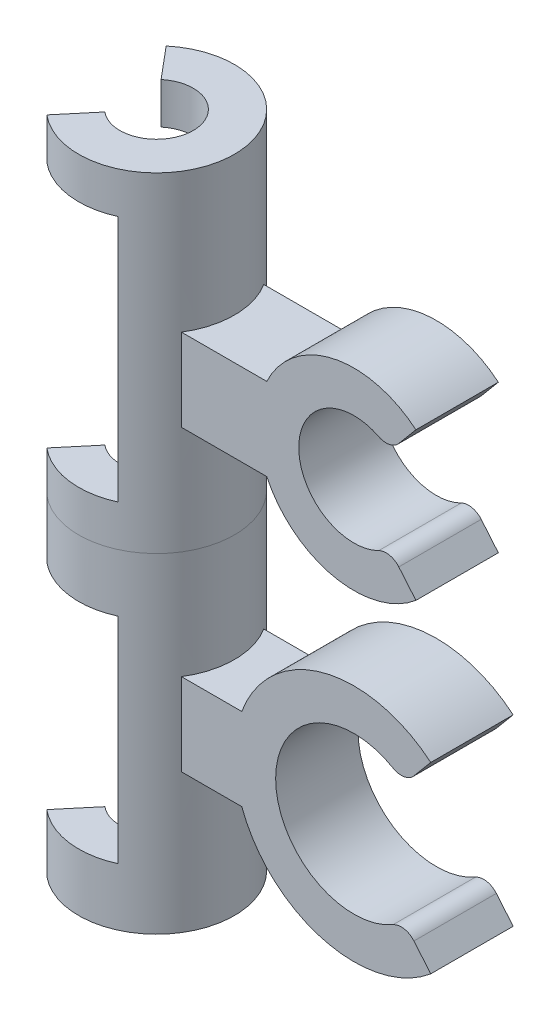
ISO-10303-21;
HEADER;
FILE_DESCRIPTION(('STEP AP214'),'2;1');
FILE_NAME('part.step','',(''),(''),'','','');
FILE_SCHEMA(('AUTOMOTIVE_DESIGN { 1 0 10303 214 1 1 1 1 }'));
ENDSEC;
DATA;
#1=APPLICATION_CONTEXT('core data for automotive mechanical design processes');
#2=APPLICATION_PROTOCOL_DEFINITION('international standard','automotive_design',2000,#1);
#3=PRODUCT_CONTEXT('',#1,'mechanical');
#4=PRODUCT('Part','Part','',(#3));
#5=PRODUCT_RELATED_PRODUCT_CATEGORY('part','',(#4));
#6=PRODUCT_DEFINITION_FORMATION('','',#4);
#7=PRODUCT_DEFINITION_CONTEXT('part definition',#1,'design');
#8=PRODUCT_DEFINITION('design','',#6,#7);
#9=PRODUCT_DEFINITION_SHAPE('','',#8);
#10=(LENGTH_UNIT() NAMED_UNIT(*) SI_UNIT(.MILLI.,.METRE.));
#11=(NAMED_UNIT(*) PLANE_ANGLE_UNIT() SI_UNIT($,.RADIAN.));
#12=(NAMED_UNIT(*) SI_UNIT($,.STERADIAN.) SOLID_ANGLE_UNIT());
#13=UNCERTAINTY_MEASURE_WITH_UNIT(LENGTH_MEASURE(1.E-05),#10,'distance_accuracy_value','');
#14=(GEOMETRIC_REPRESENTATION_CONTEXT(3) GLOBAL_UNCERTAINTY_ASSIGNED_CONTEXT((#13)) GLOBAL_UNIT_ASSIGNED_CONTEXT((#10,
#11,#12)) REPRESENTATION_CONTEXT('',''));
#15=CARTESIAN_POINT('',(0.,0.,0.));
#16=DIRECTION('',(0.,0.,1.));
#17=DIRECTION('',(1.,0.,0.));
#18=AXIS2_PLACEMENT_3D('',#15,#16,#17);
#19=CARTESIAN_POINT('',(0.,0.,0.));
#20=DIRECTION('',(0.,1.,0.));
#21=DIRECTION('',(0.,0.,1.));
#22=AXIS2_PLACEMENT_3D('',#19,#20,#21);
#23=PLANE('',#22);
#24=DIRECTION('',(0.642787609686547,0.,0.766044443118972));
#25=VECTOR('',#24,1.);
#26=CARTESIAN_POINT('',(-2.86040486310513,0.,-3.40889777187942));
#27=LINE('',#26,#25);
#28=CARTESIAN_POINT('',(-6.07434291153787,0.,-7.23911998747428));
#29=VERTEX_POINT('',#28);
#30=CARTESIAN_POINT('',(-2.86040486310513,0.,-3.40889777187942));
#31=VERTEX_POINT('',#30);
#32=EDGE_CURVE('E346',#29,#31,#27,.T.);
#33=ORIENTED_EDGE('',*,*,#32,.F.);
#34=CARTESIAN_POINT('',(0.,0.,0.));
#35=DIRECTION('',(0.,1.,0.));
#36=DIRECTION('',(0.,0.,1.));
#37=AXIS2_PLACEMENT_3D('',#34,#35,#36);
#38=CIRCLE('',#37,9.45);
#39=CARTESIAN_POINT('',(-6.07434291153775,0.,7.23911998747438));
#40=VERTEX_POINT('',#39);
#41=EDGE_CURVE('E349',#40,#29,#38,.T.);
#42=ORIENTED_EDGE('',*,*,#41,.F.);
#43=DIRECTION('',(-0.642787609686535,0.,0.766044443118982));
#44=VECTOR('',#43,1.);
#45=CARTESIAN_POINT('',(-6.07434291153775,0.,7.23911998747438));
#46=LINE('',#45,#44);
#47=CARTESIAN_POINT('',(-2.86040486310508,0.,3.40889777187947));
#48=VERTEX_POINT('',#47);
#49=EDGE_CURVE('E131',#48,#40,#46,.T.);
#50=ORIENTED_EDGE('',*,*,#49,.F.);
#51=CARTESIAN_POINT('',(0.,0.,0.));
#52=DIRECTION('',(0.,1.,0.));
#53=DIRECTION('',(0.,0.,1.));
#54=AXIS2_PLACEMENT_3D('',#51,#52,#53);
#55=CIRCLE('',#54,4.45);
#56=EDGE_CURVE('E14',#31,#48,#55,.F.);
#57=ORIENTED_EDGE('',*,*,#56,.F.);
#58=EDGE_LOOP('',(#33,#42,#50,#57));
#59=FACE_BOUND('',#58,.T.);
#60=ADVANCED_FACE('F124',(#59),#23,.F.);
#61=CARTESIAN_POINT('',(28.95,18.1,5.));
#62=DIRECTION('',(0.,0.,-1.));
#63=DIRECTION('',(-1.,0.,0.));
#64=AXIS2_PLACEMENT_3D('',#61,#62,#63);
#65=CYLINDRICAL_SURFACE('',#64,11.7);
#66=CARTESIAN_POINT('',(28.95,18.1,-5.));
#67=DIRECTION('',(0.,0.,1.));
#68=DIRECTION('',(1.,0.,0.));
#69=AXIS2_PLACEMENT_3D('',#66,#67,#68);
#70=CIRCLE('',#69,11.7);
#71=CARTESIAN_POINT('',(36.4706150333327,27.0627199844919,-5.));
#72=VERTEX_POINT('',#71);
#73=CARTESIAN_POINT('',(18.3721930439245,23.1,-5.));
#74=VERTEX_POINT('',#73);
#75=EDGE_CURVE('E410',#72,#74,#70,.T.);
#76=ORIENTED_EDGE('',*,*,#75,.T.);
#77=DIRECTION('',(0.,0.,-1.));
#78=VECTOR('',#77,1.);
#79=CARTESIAN_POINT('',(18.3721930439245,23.1,5.));
#80=LINE('',#79,#78);
#81=CARTESIAN_POINT('',(18.3721930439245,23.1,5.));
#82=VERTEX_POINT('',#81);
#83=EDGE_CURVE('E405',#82,#74,#80,.T.);
#84=ORIENTED_EDGE('',*,*,#83,.F.);
#85=CARTESIAN_POINT('',(28.95,18.1,5.));
#86=DIRECTION('',(0.,0.,1.));
#87=DIRECTION('',(1.,0.,0.));
#88=AXIS2_PLACEMENT_3D('',#85,#86,#87);
#89=CIRCLE('',#88,11.7);
#90=CARTESIAN_POINT('',(36.4706150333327,27.0627199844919,5.));
#91=VERTEX_POINT('',#90);
#92=EDGE_CURVE('E394',#91,#82,#89,.T.);
#93=ORIENTED_EDGE('',*,*,#92,.F.);
#94=DIRECTION('',(0.,0.,-1.));
#95=VECTOR('',#94,1.);
#96=CARTESIAN_POINT('',(36.4706150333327,27.0627199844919,5.));
#97=LINE('',#96,#95);
#98=EDGE_CURVE('E422',#91,#72,#97,.T.);
#99=ORIENTED_EDGE('',*,*,#98,.T.);
#100=EDGE_LOOP('',(#76,#84,#93,#99));
#101=FACE_BOUND('',#100,.T.);
#102=ADVANCED_FACE('F479',(#101),#65,.T.);
#103=CARTESIAN_POINT('',(8.07604720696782,-6.77660823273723,5.));
#104=DIRECTION('',(0.766044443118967,-0.642787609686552,0.));
#105=DIRECTION('',(0.642787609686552,0.766044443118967,0.));
#106=AXIS2_PLACEMENT_3D('',#103,#104,#105);
#107=PLANE('',#106);
#108=DIRECTION('',(-0.642787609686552,-0.766044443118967,0.));
#109=VECTOR('',#108,1.);
#110=CARTESIAN_POINT('',(8.07604720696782,-6.77660823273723,5.));
#111=LINE('',#110,#109);
#112=CARTESIAN_POINT('',(34.3924793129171,24.5860942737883,5.));
#113=VERTEX_POINT('',#112);
#114=EDGE_CURVE('E400',#91,#113,#111,.T.);
#115=ORIENTED_EDGE('',*,*,#114,.T.);
#116=DIRECTION('',(0.,0.,-1.));
#117=VECTOR('',#116,1.);
#118=CARTESIAN_POINT('',(34.3924793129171,24.5860942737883,5.));
#119=LINE('',#118,#117);
#120=CARTESIAN_POINT('',(34.3924793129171,24.5860942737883,-5.));
#121=VERTEX_POINT('',#120);
#122=EDGE_CURVE('E343',#113,#121,#119,.T.);
#123=ORIENTED_EDGE('',*,*,#122,.T.);
#124=DIRECTION('',(-0.642787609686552,-0.766044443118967,0.));
#125=VECTOR('',#124,1.);
#126=CARTESIAN_POINT('',(8.07604720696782,-6.77660823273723,-5.));
#127=LINE('',#126,#125);
#128=EDGE_CURVE('E416',#72,#121,#127,.T.);
#129=ORIENTED_EDGE('',*,*,#128,.F.);
#130=ORIENTED_EDGE('',*,*,#98,.F.);
#131=EDGE_LOOP('',(#115,#123,#129,#130));
#132=FACE_BOUND('',#131,.T.);
#133=ADVANCED_FACE('F483',(#132),#107,.T.);
#134=CARTESIAN_POINT('',(32.8603904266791,25.8716694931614,5.));
#135=DIRECTION('',(0.,0.,-1.));
#136=DIRECTION('',(-1.,0.,0.));
#137=AXIS2_PLACEMENT_3D('',#134,#135,#136);
#138=CYLINDRICAL_SURFACE('',#137,2.);
#139=CARTESIAN_POINT('',(32.8603904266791,25.8716694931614,5.));
#140=DIRECTION('',(0.,0.,1.));
#141=DIRECTION('',(1.,0.,0.));
#142=AXIS2_PLACEMENT_3D('',#139,#140,#141);
#143=CIRCLE('',#142,2.);
#144=CARTESIAN_POINT('',(31.9614500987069,24.0850788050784,5.));
#145=VERTEX_POINT('',#144);
#146=EDGE_CURVE('E339',#145,#113,#143,.T.);
#147=ORIENTED_EDGE('',*,*,#146,.F.);
#148=DIRECTION('',(0.,0.,-1.));
#149=VECTOR('',#148,1.);
#150=CARTESIAN_POINT('',(31.9614500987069,24.0850788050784,5.));
#151=LINE('',#150,#149);
#152=CARTESIAN_POINT('',(31.9614500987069,24.0850788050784,-5.));
#153=VERTEX_POINT('',#152);
#154=EDGE_CURVE('E328',#153,#145,#151,.F.);
#155=ORIENTED_EDGE('',*,*,#154,.F.);
#156=CARTESIAN_POINT('',(32.8603904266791,25.8716694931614,-5.));
#157=DIRECTION('',(0.,0.,1.));
#158=DIRECTION('',(1.,0.,0.));
#159=AXIS2_PLACEMENT_3D('',#156,#157,#158);
#160=CIRCLE('',#159,2.);
#161=EDGE_CURVE('E333',#121,#153,#160,.F.);
#162=ORIENTED_EDGE('',*,*,#161,.F.);
#163=ORIENTED_EDGE('',*,*,#122,.F.);
#164=EDGE_LOOP('',(#147,#155,#162,#163));
#165=FACE_BOUND('',#164,.T.);
#166=ADVANCED_FACE('F516',(#165),#138,.T.);
#167=CARTESIAN_POINT('',(28.95,18.1,5.));
#168=DIRECTION('',(0.,0.,-1.));
#169=DIRECTION('',(-1.,0.,0.));
#170=AXIS2_PLACEMENT_3D('',#167,#168,#169);
#171=CYLINDRICAL_SURFACE('',#170,6.7);
#172=CARTESIAN_POINT('',(28.95,18.1,5.));
#173=DIRECTION('',(0.,0.,1.));
#174=DIRECTION('',(1.,0.,0.));
#175=AXIS2_PLACEMENT_3D('',#172,#173,#174);
#176=CIRCLE('',#175,6.7);
#177=CARTESIAN_POINT('',(31.9614500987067,12.1149211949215,5.));
#178=VERTEX_POINT('',#177);
#179=EDGE_CURVE('E397',#145,#178,#176,.T.);
#180=ORIENTED_EDGE('',*,*,#179,.T.);
#181=DIRECTION('',(0.,0.,-1.));
#182=VECTOR('',#181,1.);
#183=CARTESIAN_POINT('',(31.9614500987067,12.1149211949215,5.));
#184=LINE('',#183,#182);
#185=CARTESIAN_POINT('',(31.9614500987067,12.1149211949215,-5.));
#186=VERTEX_POINT('',#185);
#187=EDGE_CURVE('E330',#178,#186,#184,.T.);
#188=ORIENTED_EDGE('',*,*,#187,.T.);
#189=CARTESIAN_POINT('',(28.95,18.1,-5.));
#190=DIRECTION('',(0.,0.,1.));
#191=DIRECTION('',(1.,0.,0.));
#192=AXIS2_PLACEMENT_3D('',#189,#190,#191);
#193=CIRCLE('',#192,6.7);
#194=EDGE_CURVE('E413',#153,#186,#193,.T.);
#195=ORIENTED_EDGE('',*,*,#194,.F.);
#196=ORIENTED_EDGE('',*,*,#154,.T.);
#197=EDGE_LOOP('',(#180,#188,#195,#196));
#198=FACE_BOUND('',#197,.T.);
#199=ADVANCED_FACE('F513',(#198),#171,.F.);
#200=CARTESIAN_POINT('',(32.8603904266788,10.3283305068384,5.));
#201=DIRECTION('',(0.,0.,-1.));
#202=DIRECTION('',(-1.,0.,0.));
#203=AXIS2_PLACEMENT_3D('',#200,#201,#202);
#204=CYLINDRICAL_SURFACE('',#203,2.);
#205=CARTESIAN_POINT('',(32.8603904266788,10.3283305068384,5.));
#206=DIRECTION('',(0.,0.,1.));
#207=DIRECTION('',(1.,0.,0.));
#208=AXIS2_PLACEMENT_3D('',#205,#206,#207);
#209=CIRCLE('',#208,2.);
#210=CARTESIAN_POINT('',(34.3924793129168,11.6139057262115,5.));
#211=VERTEX_POINT('',#210);
#212=EDGE_CURVE('E341',#211,#178,#209,.T.);
#213=ORIENTED_EDGE('',*,*,#212,.F.);
#214=DIRECTION('',(0.,0.,1.));
#215=VECTOR('',#214,1.);
#216=CARTESIAN_POINT('',(34.3924793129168,11.6139057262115,5.));
#217=LINE('',#216,#215);
#218=CARTESIAN_POINT('',(34.3924793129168,11.6139057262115,-5.));
#219=VERTEX_POINT('',#218);
#220=EDGE_CURVE('E337',#219,#211,#217,.T.);
#221=ORIENTED_EDGE('',*,*,#220,.F.);
#222=CARTESIAN_POINT('',(32.8603904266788,10.3283305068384,-5.));
#223=DIRECTION('',(0.,0.,1.));
#224=DIRECTION('',(1.,0.,0.));
#225=AXIS2_PLACEMENT_3D('',#222,#223,#224);
#226=CIRCLE('',#225,2.);
#227=EDGE_CURVE('E335',#186,#219,#226,.F.);
#228=ORIENTED_EDGE('',*,*,#227,.F.);
#229=ORIENTED_EDGE('',*,*,#187,.F.);
#230=EDGE_LOOP('',(#213,#221,#228,#229));
#231=FACE_BOUND('',#230,.T.);
#232=ADVANCED_FACE('F511',(#231),#204,.T.);
#233=CARTESIAN_POINT('',(25.9010675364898,21.7335762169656,5.));
#234=DIRECTION('',(-0.766044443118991,-0.642787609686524,0.));
#235=DIRECTION('',(0.642787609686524,-0.766044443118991,0.));
#236=AXIS2_PLACEMENT_3D('',#233,#234,#235);
#237=PLANE('',#236);
#238=DIRECTION('',(-0.642787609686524,0.766044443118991,0.));
#239=VECTOR('',#238,1.);
#240=CARTESIAN_POINT('',(25.9010675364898,21.7335762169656,-5.));
#241=LINE('',#240,#239);
#242=CARTESIAN_POINT('',(36.4706150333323,9.13728001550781,-5.));
#243=VERTEX_POINT('',#242);
#244=EDGE_CURVE('E409',#243,#219,#241,.T.);
#245=ORIENTED_EDGE('',*,*,#244,.T.);
#246=ORIENTED_EDGE('',*,*,#220,.T.);
#247=DIRECTION('',(-0.642787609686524,0.766044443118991,0.));
#248=VECTOR('',#247,1.);
#249=CARTESIAN_POINT('',(25.9010675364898,21.7335762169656,5.));
#250=LINE('',#249,#248);
#251=CARTESIAN_POINT('',(36.4706150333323,9.13728001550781,5.));
#252=VERTEX_POINT('',#251);
#253=EDGE_CURVE('E393',#252,#211,#250,.T.);
#254=ORIENTED_EDGE('',*,*,#253,.F.);
#255=DIRECTION('',(0.,0.,-1.));
#256=VECTOR('',#255,1.);
#257=CARTESIAN_POINT('',(36.4706150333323,9.13728001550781,5.));
#258=LINE('',#257,#256);
#259=EDGE_CURVE('E424',#252,#243,#258,.T.);
#260=ORIENTED_EDGE('',*,*,#259,.T.);
#261=EDGE_LOOP('',(#245,#246,#254,#260));
#262=FACE_BOUND('',#261,.T.);
#263=ADVANCED_FACE('F508',(#262),#237,.F.);
#264=CARTESIAN_POINT('',(18.3721930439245,13.1,-5.));
#265=VERTEX_POINT('',#264);
#266=EDGE_CURVE('E407',#265,#243,#70,.T.);
#267=ORIENTED_EDGE('',*,*,#266,.T.);
#268=ORIENTED_EDGE('',*,*,#259,.F.);
#269=CARTESIAN_POINT('',(18.3721930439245,13.1,5.));
#270=VERTEX_POINT('',#269);
#271=EDGE_CURVE('E390',#270,#252,#89,.T.);
#272=ORIENTED_EDGE('',*,*,#271,.F.);
#273=DIRECTION('',(0.,0.,-1.));
#274=VECTOR('',#273,1.);
#275=CARTESIAN_POINT('',(18.3721930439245,13.1,5.));
#276=LINE('',#275,#274);
#277=EDGE_CURVE('E427',#270,#265,#276,.T.);
#278=ORIENTED_EDGE('',*,*,#277,.T.);
#279=EDGE_LOOP('',(#267,#268,#272,#278));
#280=FACE_BOUND('',#279,.T.);
#281=ADVANCED_FACE('F486',(#280),#65,.T.);
#282=CARTESIAN_POINT('',(0.,5.,-9.45));
#283=DIRECTION('',(0.,1.,0.));
#284=DIRECTION('',(0.,0.,1.));
#285=AXIS2_PLACEMENT_3D('',#282,#283,#284);
#286=PLANE('',#285);
#287=CARTESIAN_POINT('',(0.,5.,0.));
#288=DIRECTION('',(0.,1.,0.));
#289=DIRECTION('',(0.,0.,1.));
#290=AXIS2_PLACEMENT_3D('',#287,#288,#289);
#291=CIRCLE('',#290,4.45);
#292=CARTESIAN_POINT('',(3.92565708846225,5.,2.09564224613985));
#293=VERTEX_POINT('',#292);
#294=CARTESIAN_POINT('',(-2.86040486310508,5.,3.40889777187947));
#295=VERTEX_POINT('',#294);
#296=EDGE_CURVE('E285',#293,#295,#291,.F.);
#297=ORIENTED_EDGE('',*,*,#296,.T.);
#298=DIRECTION('',(-0.642787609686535,0.,0.766044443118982));
#299=VECTOR('',#298,1.);
#300=CARTESIAN_POINT('',(-6.07434291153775,5.,7.23911998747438));
#301=LINE('',#300,#299);
#302=CARTESIAN_POINT('',(-6.07434291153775,5.,7.23911998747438));
#303=VERTEX_POINT('',#302);
#304=EDGE_CURVE('E370',#295,#303,#301,.T.);
#305=ORIENTED_EDGE('',*,*,#304,.T.);
#306=CARTESIAN_POINT('',(0.,5.,0.));
#307=DIRECTION('',(0.,1.,0.));
#308=DIRECTION('',(0.,0.,1.));
#309=AXIS2_PLACEMENT_3D('',#306,#307,#308);
#310=CIRCLE('',#309,9.45);
#311=CARTESIAN_POINT('',(3.92565708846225,5.,8.59602910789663));
#312=VERTEX_POINT('',#311);
#313=EDGE_CURVE('E368',#303,#312,#310,.T.);
#314=ORIENTED_EDGE('',*,*,#313,.T.);
#315=DIRECTION('',(0.,0.,1.));
#316=VECTOR('',#315,1.);
#317=CARTESIAN_POINT('',(3.92565708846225,5.,-9.45));
#318=LINE('',#317,#316);
#319=EDGE_CURVE('E456',#293,#312,#318,.T.);
#320=ORIENTED_EDGE('',*,*,#319,.F.);
#321=EDGE_LOOP('',(#297,#305,#314,#320));
#322=FACE_BOUND('',#321,.T.);
#323=ADVANCED_FACE('F460',(#322),#286,.T.);
#324=CARTESIAN_POINT('',(3.92565708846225,0.,-9.45));
#325=DIRECTION('',(-1.,0.,0.));
#326=DIRECTION('',(0.,-1.,0.));
#327=AXIS2_PLACEMENT_3D('',#324,#325,#326);
#328=PLANE('',#327);
#329=DIRECTION('',(0.,-1.,0.));
#330=VECTOR('',#329,1.);
#331=CARTESIAN_POINT('',(3.92565708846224,40.,2.09564224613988));
#332=LINE('',#331,#330);
#333=CARTESIAN_POINT('',(3.92565708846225,35.,2.09564224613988));
#334=VERTEX_POINT('',#333);
#335=EDGE_CURVE('E384',#334,#293,#332,.T.);
#336=ORIENTED_EDGE('',*,*,#335,.T.);
#337=ORIENTED_EDGE('',*,*,#319,.T.);
#338=DIRECTION('',(0.,-1.,0.));
#339=VECTOR('',#338,1.);
#340=CARTESIAN_POINT('',(3.92565708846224,40.,8.59602910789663));
#341=LINE('',#340,#339);
#342=CARTESIAN_POINT('',(3.92565708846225,35.,8.59602910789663));
#343=VERTEX_POINT('',#342);
#344=EDGE_CURVE('E295',#312,#343,#341,.F.);
#345=ORIENTED_EDGE('',*,*,#344,.T.);
#346=DIRECTION('',(0.,0.,1.));
#347=VECTOR('',#346,1.);
#348=CARTESIAN_POINT('',(3.92565708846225,35.,-9.45));
#349=LINE('',#348,#347);
#350=EDGE_CURVE('E451',#334,#343,#349,.T.);
#351=ORIENTED_EDGE('',*,*,#350,.F.);
#352=EDGE_LOOP('',(#336,#337,#345,#351));
#353=FACE_BOUND('',#352,.T.);
#354=ADVANCED_FACE('F459',(#353),#328,.T.);
#355=CARTESIAN_POINT('',(0.,35.,-9.45));
#356=DIRECTION('',(0.,-1.,0.));
#357=DIRECTION('',(0.,0.,-1.));
#358=AXIS2_PLACEMENT_3D('',#355,#356,#357);
#359=PLANE('',#358);
#360=CARTESIAN_POINT('',(0.,35.,0.));
#361=DIRECTION('',(0.,-1.,0.));
#362=DIRECTION('',(0.,0.,-1.));
#363=AXIS2_PLACEMENT_3D('',#360,#361,#362);
#364=CIRCLE('',#363,4.45);
#365=CARTESIAN_POINT('',(-2.86040486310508,35.,3.40889777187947));
#366=VERTEX_POINT('',#365);
#367=EDGE_CURVE('E382',#366,#334,#364,.F.);
#368=ORIENTED_EDGE('',*,*,#367,.T.);
#369=ORIENTED_EDGE('',*,*,#350,.T.);
#370=CARTESIAN_POINT('',(0.,35.,0.));
#371=DIRECTION('',(0.,-1.,0.));
#372=DIRECTION('',(0.,0.,-1.));
#373=AXIS2_PLACEMENT_3D('',#370,#371,#372);
#374=CIRCLE('',#373,9.45);
#375=CARTESIAN_POINT('',(-6.07434291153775,35.,7.23911998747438));
#376=VERTEX_POINT('',#375);
#377=EDGE_CURVE('E287',#343,#376,#374,.T.);
#378=ORIENTED_EDGE('',*,*,#377,.T.);
#379=DIRECTION('',(0.642787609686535,0.,-0.766044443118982));
#380=VECTOR('',#379,1.);
#381=CARTESIAN_POINT('',(-6.07434291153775,35.,7.23911998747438));
#382=LINE('',#381,#380);
#383=EDGE_CURVE('E380',#376,#366,#382,.T.);
#384=ORIENTED_EDGE('',*,*,#383,.T.);
#385=EDGE_LOOP('',(#368,#369,#378,#384));
#386=FACE_BOUND('',#385,.T.);
#387=ADVANCED_FACE('F449',(#386),#359,.T.);
#388=CARTESIAN_POINT('',(-6.07434291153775,40.,7.23911998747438));
#389=DIRECTION('',(0.766044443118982,0.,0.642787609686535));
#390=DIRECTION('',(0.642787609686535,0.,-0.766044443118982));
#391=AXIS2_PLACEMENT_3D('',#388,#389,#390);
#392=PLANE('',#391);
#393=ORIENTED_EDGE('',*,*,#383,.F.);
#394=DIRECTION('',(0.,-1.,0.));
#395=VECTOR('',#394,1.);
#396=CARTESIAN_POINT('',(-6.07434291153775,40.,7.23911998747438));
#397=LINE('',#396,#395);
#398=CARTESIAN_POINT('',(-6.07434291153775,40.,7.23911998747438));
#399=VERTEX_POINT('',#398);
#400=EDGE_CURVE('E303',#399,#376,#397,.T.);
#401=ORIENTED_EDGE('',*,*,#400,.F.);
#402=DIRECTION('',(-0.642787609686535,0.,0.766044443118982));
#403=VECTOR('',#402,1.);
#404=CARTESIAN_POINT('',(-6.07434291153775,40.,7.23911998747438));
#405=LINE('',#404,#403);
#406=CARTESIAN_POINT('',(-2.86040486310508,40.,3.40889777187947));
#407=VERTEX_POINT('',#406);
#408=EDGE_CURVE('E433',#407,#399,#405,.T.);
#409=ORIENTED_EDGE('',*,*,#408,.F.);
#410=DIRECTION('',(0.,-1.,0.));
#411=VECTOR('',#410,1.);
#412=CARTESIAN_POINT('',(-2.86040486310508,40.,3.40889777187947));
#413=LINE('',#412,#411);
#414=EDGE_CURVE('E312',#407,#366,#413,.T.);
#415=ORIENTED_EDGE('',*,*,#414,.T.);
#416=EDGE_LOOP('',(#393,#401,#409,#415));
#417=FACE_BOUND('',#416,.T.);
#418=ADVANCED_FACE('F444',(#417),#392,.F.);
#419=CARTESIAN_POINT('',(0.,40.,0.));
#420=DIRECTION('',(0.,1.,0.));
#421=DIRECTION('',(0.,0.,1.));
#422=AXIS2_PLACEMENT_3D('',#419,#420,#421);
#423=PLANE('',#422);
#424=CARTESIAN_POINT('',(0.,40.,0.));
#425=DIRECTION('',(0.,-1.,0.));
#426=DIRECTION('',(0.,0.,1.));
#427=AXIS2_PLACEMENT_3D('',#424,#425,#426);
#428=CIRCLE('',#427,4.45);
#429=CARTESIAN_POINT('',(-2.86040486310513,40.,-3.40889777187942));
#430=VERTEX_POINT('',#429);
#431=EDGE_CURVE('E430',#430,#407,#428,.T.);
#432=ORIENTED_EDGE('',*,*,#431,.T.);
#433=ORIENTED_EDGE('',*,*,#408,.T.);
#434=CARTESIAN_POINT('',(0.,40.,0.));
#435=DIRECTION('',(0.,1.,0.));
#436=DIRECTION('',(0.,0.,1.));
#437=AXIS2_PLACEMENT_3D('',#434,#435,#436);
#438=CIRCLE('',#437,9.45);
#439=CARTESIAN_POINT('',(-6.07434291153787,40.,-7.23911998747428));
#440=VERTEX_POINT('',#439);
#441=EDGE_CURVE('E435',#399,#440,#438,.T.);
#442=ORIENTED_EDGE('',*,*,#441,.T.);
#443=DIRECTION('',(0.642787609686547,0.,0.766044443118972));
#444=VECTOR('',#443,1.);
#445=CARTESIAN_POINT('',(-2.86040486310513,40.,-3.40889777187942));
#446=LINE('',#445,#444);
#447=EDGE_CURVE('E299',#440,#430,#446,.T.);
#448=ORIENTED_EDGE('',*,*,#447,.T.);
#449=EDGE_LOOP('',(#432,#433,#442,#448));
#450=FACE_BOUND('',#449,.T.);
#451=ADVANCED_FACE('F440',(#450),#423,.T.);
#452=CARTESIAN_POINT('',(-2.86040486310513,40.,-3.40889777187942));
#453=DIRECTION('',(0.766044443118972,0.,-0.642787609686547));
#454=DIRECTION('',(-0.642787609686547,0.,-0.766044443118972));
#455=AXIS2_PLACEMENT_3D('',#452,#453,#454);
#456=PLANE('',#455);
#457=DIRECTION('',(-0.642787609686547,0.,-0.766044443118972));
#458=VECTOR('',#457,1.);
#459=CARTESIAN_POINT('',(-2.86040486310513,35.,-3.40889777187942));
#460=LINE('',#459,#458);
#461=CARTESIAN_POINT('',(-2.86040486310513,35.,-3.40889777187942));
#462=VERTEX_POINT('',#461);
#463=CARTESIAN_POINT('',(-6.07434291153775,35.,-7.23911998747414));
#464=VERTEX_POINT('',#463);
#465=EDGE_CURVE('E289',#462,#464,#460,.T.);
#466=ORIENTED_EDGE('',*,*,#465,.F.);
#467=DIRECTION('',(0.,-1.,0.));
#468=VECTOR('',#467,1.);
#469=CARTESIAN_POINT('',(-2.86040486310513,40.,-3.40889777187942));
#470=LINE('',#469,#468);
#471=EDGE_CURVE('E306',#430,#462,#470,.T.);
#472=ORIENTED_EDGE('',*,*,#471,.F.);
#473=ORIENTED_EDGE('',*,*,#447,.F.);
#474=DIRECTION('',(0.,-1.,0.));
#475=VECTOR('',#474,1.);
#476=CARTESIAN_POINT('',(-6.07434291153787,40.,-7.23911998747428));
#477=LINE('',#476,#475);
#478=EDGE_CURVE('E277',#440,#464,#477,.T.);
#479=ORIENTED_EDGE('',*,*,#478,.T.);
#480=EDGE_LOOP('',(#466,#472,#473,#479));
#481=FACE_BOUND('',#480,.T.);
#482=ADVANCED_FACE('F298',(#481),#456,.F.);
#483=CARTESIAN_POINT('',(3.92565708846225,35.,-2.09564224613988));
#484=VERTEX_POINT('',#483);
#485=EDGE_CURVE('E284',#484,#462,#364,.F.);
#486=ORIENTED_EDGE('',*,*,#485,.T.);
#487=ORIENTED_EDGE('',*,*,#465,.T.);
#488=CARTESIAN_POINT('',(3.92565708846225,35.,-8.59602910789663));
#489=VERTEX_POINT('',#488);
#490=EDGE_CURVE('E271',#464,#489,#374,.T.);
#491=ORIENTED_EDGE('',*,*,#490,.T.);
#492=EDGE_CURVE('E372',#489,#484,#349,.T.);
#493=ORIENTED_EDGE('',*,*,#492,.T.);
#494=EDGE_LOOP('',(#486,#487,#491,#493));
#495=FACE_BOUND('',#494,.T.);
#496=ADVANCED_FACE('F290',(#495),#359,.T.);
#497=DIRECTION('',(0.,-1.,0.));
#498=VECTOR('',#497,1.);
#499=CARTESIAN_POINT('',(3.92565708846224,40.,-2.09564224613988));
#500=LINE('',#499,#498);
#501=CARTESIAN_POINT('',(3.92565708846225,5.,-2.09564224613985));
#502=VERTEX_POINT('',#501);
#503=EDGE_CURVE('E367',#502,#484,#500,.F.);
#504=ORIENTED_EDGE('',*,*,#503,.T.);
#505=ORIENTED_EDGE('',*,*,#492,.F.);
#506=DIRECTION('',(0.,-1.,0.));
#507=VECTOR('',#506,1.);
#508=CARTESIAN_POINT('',(3.92565708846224,40.,-8.59602910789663));
#509=LINE('',#508,#507);
#510=CARTESIAN_POINT('',(3.92565708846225,5.,-8.59602910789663));
#511=VERTEX_POINT('',#510);
#512=EDGE_CURVE('E280',#489,#511,#509,.T.);
#513=ORIENTED_EDGE('',*,*,#512,.T.);
#514=EDGE_CURVE('E454',#511,#502,#318,.T.);
#515=ORIENTED_EDGE('',*,*,#514,.T.);
#516=EDGE_LOOP('',(#504,#505,#513,#515));
#517=FACE_BOUND('',#516,.T.);
#518=ADVANCED_FACE('F464',(#517),#328,.T.);
#519=EDGE_CURVE('E311',#295,#48,#413,.T.);
#520=ORIENTED_EDGE('',*,*,#519,.T.);
#521=ORIENTED_EDGE('',*,*,#49,.T.);
#522=EDGE_CURVE('E300',#303,#40,#397,.T.);
#523=ORIENTED_EDGE('',*,*,#522,.F.);
#524=ORIENTED_EDGE('',*,*,#304,.F.);
#525=EDGE_LOOP('',(#520,#521,#523,#524));
#526=FACE_BOUND('',#525,.T.);
#527=ADVANCED_FACE('F461',(#526),#392,.F.);
#528=CARTESIAN_POINT('',(0.,0.,-5.));
#529=DIRECTION('',(0.,0.,1.));
#530=DIRECTION('',(1.,0.,0.));
#531=AXIS2_PLACEMENT_3D('',#528,#529,#530);
#532=PLANE('',#531);
#533=ORIENTED_EDGE('',*,*,#194,.T.);
#534=ORIENTED_EDGE('',*,*,#227,.T.);
#535=ORIENTED_EDGE('',*,*,#244,.F.);
#536=ORIENTED_EDGE('',*,*,#266,.F.);
#537=DIRECTION('',(1.,0.,0.));
#538=VECTOR('',#537,1.);
#539=CARTESIAN_POINT('',(0.,13.1,-5.));
#540=LINE('',#539,#538);
#541=CARTESIAN_POINT('',(8.01888396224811,13.1,-5.));
#542=VERTEX_POINT('',#541);
#543=EDGE_CURVE('E387',#542,#265,#540,.T.);
#544=ORIENTED_EDGE('',*,*,#543,.F.);
#545=DIRECTION('',(0.,-1.,0.));
#546=VECTOR('',#545,1.);
#547=CARTESIAN_POINT('',(8.01888396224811,40.,-5.));
#548=LINE('',#547,#546);
#549=CARTESIAN_POINT('',(8.01888396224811,23.1,-5.));
#550=VERTEX_POINT('',#549);
#551=EDGE_CURVE('E315',#542,#550,#548,.F.);
#552=ORIENTED_EDGE('',*,*,#551,.T.);
#553=DIRECTION('',(1.,0.,0.));
#554=VECTOR('',#553,1.);
#555=CARTESIAN_POINT('',(0.,23.1,-5.));
#556=LINE('',#555,#554);
#557=EDGE_CURVE('E391',#550,#74,#556,.T.);
#558=ORIENTED_EDGE('',*,*,#557,.T.);
#559=ORIENTED_EDGE('',*,*,#75,.F.);
#560=ORIENTED_EDGE('',*,*,#128,.T.);
#561=ORIENTED_EDGE('',*,*,#161,.T.);
#562=EDGE_LOOP('',(#533,#534,#535,#536,#544,#552,#558,#559,#560,#561));
#563=FACE_BOUND('',#562,.T.);
#564=ADVANCED_FACE('F463',(#563),#532,.F.);
#565=CARTESIAN_POINT('',(0.,23.1,5.));
#566=DIRECTION('',(0.,1.,0.));
#567=DIRECTION('',(-1.,0.,0.));
#568=AXIS2_PLACEMENT_3D('',#565,#566,#567);
#569=PLANE('',#568);
#570=CARTESIAN_POINT('',(0.,23.1,0.));
#571=DIRECTION('',(0.,1.,0.));
#572=DIRECTION('',(-1.,0.,0.));
#573=AXIS2_PLACEMENT_3D('',#570,#571,#572);
#574=CIRCLE('',#573,9.45);
#575=CARTESIAN_POINT('',(8.01888396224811,23.1,5.));
#576=VERTEX_POINT('',#575);
#577=EDGE_CURVE('E318',#576,#550,#574,.T.);
#578=ORIENTED_EDGE('',*,*,#577,.F.);
#579=DIRECTION('',(1.,0.,0.));
#580=VECTOR('',#579,1.);
#581=CARTESIAN_POINT('',(0.,23.1,5.));
#582=LINE('',#581,#580);
#583=EDGE_CURVE('E403',#576,#82,#582,.T.);
#584=ORIENTED_EDGE('',*,*,#583,.T.);
#585=ORIENTED_EDGE('',*,*,#83,.T.);
#586=ORIENTED_EDGE('',*,*,#557,.F.);
#587=EDGE_LOOP('',(#578,#584,#585,#586));
#588=FACE_BOUND('',#587,.T.);
#589=ADVANCED_FACE('F470',(#588),#569,.T.);
#590=CARTESIAN_POINT('',(0.,0.,5.));
#591=DIRECTION('',(0.,0.,1.));
#592=DIRECTION('',(1.,0.,0.));
#593=AXIS2_PLACEMENT_3D('',#590,#591,#592);
#594=PLANE('',#593);
#595=ORIENTED_EDGE('',*,*,#253,.T.);
#596=ORIENTED_EDGE('',*,*,#212,.T.);
#597=ORIENTED_EDGE('',*,*,#179,.F.);
#598=ORIENTED_EDGE('',*,*,#146,.T.);
#599=ORIENTED_EDGE('',*,*,#114,.F.);
#600=ORIENTED_EDGE('',*,*,#92,.T.);
#601=ORIENTED_EDGE('',*,*,#583,.F.);
#602=DIRECTION('',(0.,-1.,0.));
#603=VECTOR('',#602,1.);
#604=CARTESIAN_POINT('',(8.01888396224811,40.,5.));
#605=LINE('',#604,#603);
#606=CARTESIAN_POINT('',(8.01888396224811,13.1,5.));
#607=VERTEX_POINT('',#606);
#608=EDGE_CURVE('E323',#607,#576,#605,.F.);
#609=ORIENTED_EDGE('',*,*,#608,.F.);
#610=DIRECTION('',(1.,0.,0.));
#611=VECTOR('',#610,1.);
#612=CARTESIAN_POINT('',(0.,13.1,5.));
#613=LINE('',#612,#611);
#614=EDGE_CURVE('E388',#607,#270,#613,.T.);
#615=ORIENTED_EDGE('',*,*,#614,.T.);
#616=ORIENTED_EDGE('',*,*,#271,.T.);
#617=EDGE_LOOP('',(#595,#596,#597,#598,#599,#600,#601,#609,#615,#616));
#618=FACE_BOUND('',#617,.T.);
#619=ADVANCED_FACE('F506',(#618),#594,.T.);
#620=CARTESIAN_POINT('',(0.,13.1,5.));
#621=DIRECTION('',(0.,1.,0.));
#622=DIRECTION('',(-1.,0.,0.));
#623=AXIS2_PLACEMENT_3D('',#620,#621,#622);
#624=PLANE('',#623);
#625=ORIENTED_EDGE('',*,*,#614,.F.);
#626=CARTESIAN_POINT('',(0.,13.1,0.));
#627=DIRECTION('',(0.,1.,0.));
#628=DIRECTION('',(-1.,0.,0.));
#629=AXIS2_PLACEMENT_3D('',#626,#627,#628);
#630=CIRCLE('',#629,9.45);
#631=EDGE_CURVE('E320',#607,#542,#630,.T.);
#632=ORIENTED_EDGE('',*,*,#631,.T.);
#633=ORIENTED_EDGE('',*,*,#543,.T.);
#634=ORIENTED_EDGE('',*,*,#277,.F.);
#635=EDGE_LOOP('',(#625,#632,#633,#634));
#636=FACE_BOUND('',#635,.T.);
#637=ADVANCED_FACE('F503',(#636),#624,.F.);
#638=CARTESIAN_POINT('',(-2.86040486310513,5.,-3.40889777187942));
#639=VERTEX_POINT('',#638);
#640=EDGE_CURVE('E362',#639,#502,#291,.F.);
#641=ORIENTED_EDGE('',*,*,#640,.T.);
#642=ORIENTED_EDGE('',*,*,#514,.F.);
#643=CARTESIAN_POINT('',(-6.07434291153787,5.,-7.23911998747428));
#644=VERTEX_POINT('',#643);
#645=EDGE_CURVE('E364',#511,#644,#310,.T.);
#646=ORIENTED_EDGE('',*,*,#645,.T.);
#647=DIRECTION('',(0.642787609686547,0.,0.766044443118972));
#648=VECTOR('',#647,1.);
#649=CARTESIAN_POINT('',(-2.86040486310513,5.,-3.40889777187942));
#650=LINE('',#649,#648);
#651=EDGE_CURVE('E296',#644,#639,#650,.T.);
#652=ORIENTED_EDGE('',*,*,#651,.T.);
#653=EDGE_LOOP('',(#641,#642,#646,#652));
#654=FACE_BOUND('',#653,.T.);
#655=ADVANCED_FACE('F360',(#654),#286,.T.);
#656=CARTESIAN_POINT('',(0.,40.,0.));
#657=DIRECTION('',(0.,-1.,0.));
#658=DIRECTION('',(0.,0.,-1.));
#659=AXIS2_PLACEMENT_3D('',#656,#657,#658);
#660=CYLINDRICAL_SURFACE('',#659,4.45);
#661=EDGE_CURVE('E357',#639,#31,#470,.T.);
#662=ORIENTED_EDGE('',*,*,#661,.T.);
#663=ORIENTED_EDGE('',*,*,#56,.T.);
#664=ORIENTED_EDGE('',*,*,#519,.F.);
#665=ORIENTED_EDGE('',*,*,#296,.F.);
#666=ORIENTED_EDGE('',*,*,#335,.F.);
#667=ORIENTED_EDGE('',*,*,#367,.F.);
#668=ORIENTED_EDGE('',*,*,#414,.F.);
#669=ORIENTED_EDGE('',*,*,#431,.F.);
#670=ORIENTED_EDGE('',*,*,#471,.T.);
#671=ORIENTED_EDGE('',*,*,#485,.F.);
#672=ORIENTED_EDGE('',*,*,#503,.F.);
#673=ORIENTED_EDGE('',*,*,#640,.F.);
#674=EDGE_LOOP('',(#662,#663,#664,#665,#666,#667,#668,#669,#670,#671,#672,#673));
#675=FACE_BOUND('',#674,.T.);
#676=ADVANCED_FACE('F366',(#675),#660,.F.);
#677=CARTESIAN_POINT('',(0.,40.,0.));
#678=DIRECTION('',(0.,-1.,0.));
#679=DIRECTION('',(0.,0.,-1.));
#680=AXIS2_PLACEMENT_3D('',#677,#678,#679);
#681=CYLINDRICAL_SURFACE('',#680,9.45);
#682=ORIENTED_EDGE('',*,*,#631,.F.);
#683=ORIENTED_EDGE('',*,*,#608,.T.);
#684=ORIENTED_EDGE('',*,*,#577,.T.);
#685=ORIENTED_EDGE('',*,*,#551,.F.);
#686=EDGE_LOOP('',(#682,#683,#684,#685));
#687=FACE_BOUND('',#686,.T.);
#688=ORIENTED_EDGE('',*,*,#522,.T.);
#689=ORIENTED_EDGE('',*,*,#41,.T.);
#690=EDGE_CURVE('E301',#644,#29,#477,.T.);
#691=ORIENTED_EDGE('',*,*,#690,.F.);
#692=ORIENTED_EDGE('',*,*,#645,.F.);
#693=ORIENTED_EDGE('',*,*,#512,.F.);
#694=ORIENTED_EDGE('',*,*,#490,.F.);
#695=ORIENTED_EDGE('',*,*,#478,.F.);
#696=ORIENTED_EDGE('',*,*,#441,.F.);
#697=ORIENTED_EDGE('',*,*,#400,.T.);
#698=ORIENTED_EDGE('',*,*,#377,.F.);
#699=ORIENTED_EDGE('',*,*,#344,.F.);
#700=ORIENTED_EDGE('',*,*,#313,.F.);
#701=EDGE_LOOP('',(#688,#689,#691,#692,#693,#694,#695,#696,#697,#698,#699,#700));
#702=FACE_BOUND('',#701,.T.);
#703=ADVANCED_FACE('F274',(#687,#702),#681,.T.);
#704=ORIENTED_EDGE('',*,*,#690,.T.);
#705=ORIENTED_EDGE('',*,*,#32,.T.);
#706=ORIENTED_EDGE('',*,*,#661,.F.);
#707=ORIENTED_EDGE('',*,*,#651,.F.);
#708=EDGE_LOOP('',(#704,#705,#706,#707));
#709=FACE_BOUND('',#708,.T.);
#710=ADVANCED_FACE('F356',(#709),#456,.F.);
#711=CLOSED_SHELL('',(#60,#102,#133,#166,#199,#232,#263,#281,#323,#354,#387,#418,#451,#482,#496,
#518,#527,#564,#589,#619,#637,#655,#676,#703,#710));
#712=MANIFOLD_SOLID_BREP('B2',#711);
#713=CARTESIAN_POINT('',(0.,0.,0.));
#714=DIRECTION('',(0.,1.,0.));
#715=DIRECTION('',(0.,0.,1.));
#716=AXIS2_PLACEMENT_3D('',#713,#714,#715);
#717=PLANE('',#716);
#718=DIRECTION('',(0.642787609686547,0.,0.766044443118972));
#719=VECTOR('',#718,1.);
#720=CARTESIAN_POINT('',(-2.86040486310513,0.,-3.40889777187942));
#721=LINE('',#720,#719);
#722=CARTESIAN_POINT('',(-6.07434291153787,0.,-7.23911998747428));
#723=VERTEX_POINT('',#722);
#724=CARTESIAN_POINT('',(-2.86040486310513,0.,-3.40889777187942));
#725=VERTEX_POINT('',#724);
#726=EDGE_CURVE('E920',#723,#725,#721,.T.);
#727=ORIENTED_EDGE('',*,*,#726,.T.);
#728=CARTESIAN_POINT('',(0.,0.,0.));
#729=DIRECTION('',(0.,1.,0.));
#730=DIRECTION('',(0.,0.,1.));
#731=AXIS2_PLACEMENT_3D('',#728,#729,#730);
#732=CIRCLE('',#731,4.45);
#733=CARTESIAN_POINT('',(-2.86040486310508,0.,3.40889777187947));
#734=VERTEX_POINT('',#733);
#735=EDGE_CURVE('E1062',#725,#734,#732,.F.);
#736=ORIENTED_EDGE('',*,*,#735,.T.);
#737=DIRECTION('',(-0.642787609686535,0.,0.766044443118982));
#738=VECTOR('',#737,1.);
#739=CARTESIAN_POINT('',(-6.07434291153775,0.,7.23911998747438));
#740=LINE('',#739,#738);
#741=CARTESIAN_POINT('',(-6.07434291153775,0.,7.23911998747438));
#742=VERTEX_POINT('',#741);
#743=EDGE_CURVE('E922',#734,#742,#740,.T.);
#744=ORIENTED_EDGE('',*,*,#743,.T.);
#745=CARTESIAN_POINT('',(0.,0.,0.));
#746=DIRECTION('',(0.,1.,0.));
#747=DIRECTION('',(0.,0.,1.));
#748=AXIS2_PLACEMENT_3D('',#745,#746,#747);
#749=CIRCLE('',#748,9.45);
#750=EDGE_CURVE('E909',#742,#723,#749,.T.);
#751=ORIENTED_EDGE('',*,*,#750,.T.);
#752=EDGE_LOOP('',(#727,#736,#744,#751));
#753=FACE_BOUND('',#752,.T.);
#754=ADVANCED_FACE('F757',(#753),#717,.T.);
#755=CARTESIAN_POINT('',(0.,40.,0.));
#756=DIRECTION('',(0.,-1.,0.));
#757=DIRECTION('',(0.,0.,-1.));
#758=AXIS2_PLACEMENT_3D('',#755,#756,#757);
#759=CYLINDRICAL_SURFACE('',#758,4.45);
#760=ORIENTED_EDGE('',*,*,#735,.F.);
#761=DIRECTION('',(0.,-1.,0.));
#762=VECTOR('',#761,1.);
#763=CARTESIAN_POINT('',(-2.86040486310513,40.,-3.40889777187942));
#764=LINE('',#763,#762);
#765=CARTESIAN_POINT('',(-2.86040486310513,-7.,-3.40889777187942));
#766=VERTEX_POINT('',#765);
#767=EDGE_CURVE('E761',#725,#766,#764,.T.);
#768=ORIENTED_EDGE('',*,*,#767,.T.);
#769=CARTESIAN_POINT('',(0.,-7.,0.));
#770=DIRECTION('',(0.,-1.,0.));
#771=DIRECTION('',(1.,0.,0.));
#772=AXIS2_PLACEMENT_3D('',#769,#770,#771);
#773=CIRCLE('',#772,4.45);
#774=CARTESIAN_POINT('',(3.92565708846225,-7.,-2.09564224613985));
#775=VERTEX_POINT('',#774);
#776=EDGE_CURVE('E1051',#775,#766,#773,.F.);
#777=ORIENTED_EDGE('',*,*,#776,.F.);
#778=DIRECTION('',(0.,-1.,0.));
#779=VECTOR('',#778,1.);
#780=CARTESIAN_POINT('',(3.92565708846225,40.,-2.09564224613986));
#781=LINE('',#780,#779);
#782=CARTESIAN_POINT('',(3.92565708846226,-33.,-2.09564224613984));
#783=VERTEX_POINT('',#782);
#784=EDGE_CURVE('E1009',#783,#775,#781,.F.);
#785=ORIENTED_EDGE('',*,*,#784,.F.);
#786=CARTESIAN_POINT('',(0.,-33.,0.));
#787=DIRECTION('',(0.,1.,0.));
#788=DIRECTION('',(-1.,0.,0.));
#789=AXIS2_PLACEMENT_3D('',#786,#787,#788);
#790=CIRCLE('',#789,4.45);
#791=CARTESIAN_POINT('',(-2.86040486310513,-33.,-3.40889777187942));
#792=VERTEX_POINT('',#791);
#793=EDGE_CURVE('E1039',#792,#783,#790,.F.);
#794=ORIENTED_EDGE('',*,*,#793,.F.);
#795=CARTESIAN_POINT('',(-2.86040486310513,-40.,-3.40889777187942));
#796=VERTEX_POINT('',#795);
#797=EDGE_CURVE('E964',#792,#796,#764,.T.);
#798=ORIENTED_EDGE('',*,*,#797,.T.);
#799=CARTESIAN_POINT('',(0.,-40.,0.));
#800=DIRECTION('',(0.,-1.,0.));
#801=DIRECTION('',(0.,0.,1.));
#802=AXIS2_PLACEMENT_3D('',#799,#800,#801);
#803=CIRCLE('',#802,4.45);
#804=CARTESIAN_POINT('',(-2.86040486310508,-40.,3.40889777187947));
#805=VERTEX_POINT('',#804);
#806=EDGE_CURVE('E956',#796,#805,#803,.T.);
#807=ORIENTED_EDGE('',*,*,#806,.T.);
#808=DIRECTION('',(0.,-1.,0.));
#809=VECTOR('',#808,1.);
#810=CARTESIAN_POINT('',(-2.86040486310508,40.,3.40889777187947));
#811=LINE('',#810,#809);
#812=CARTESIAN_POINT('',(-2.86040486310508,-33.,3.40889777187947));
#813=VERTEX_POINT('',#812);
#814=EDGE_CURVE('E934',#813,#805,#811,.T.);
#815=ORIENTED_EDGE('',*,*,#814,.F.);
#816=CARTESIAN_POINT('',(3.92565708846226,-33.,2.09564224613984));
#817=VERTEX_POINT('',#816);
#818=EDGE_CURVE('E1035',#817,#813,#790,.F.);
#819=ORIENTED_EDGE('',*,*,#818,.F.);
#820=DIRECTION('',(0.,-1.,0.));
#821=VECTOR('',#820,1.);
#822=CARTESIAN_POINT('',(3.92565708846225,40.,2.09564224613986));
#823=LINE('',#822,#821);
#824=CARTESIAN_POINT('',(3.92565708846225,-7.,2.09564224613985));
#825=VERTEX_POINT('',#824);
#826=EDGE_CURVE('E1032',#825,#817,#823,.T.);
#827=ORIENTED_EDGE('',*,*,#826,.F.);
#828=CARTESIAN_POINT('',(-2.86040486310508,-7.,3.40889777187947));
#829=VERTEX_POINT('',#828);
#830=EDGE_CURVE('E1050',#829,#825,#773,.F.);
#831=ORIENTED_EDGE('',*,*,#830,.F.);
#832=EDGE_CURVE('E931',#734,#829,#811,.T.);
#833=ORIENTED_EDGE('',*,*,#832,.F.);
#834=EDGE_LOOP('',(#760,#768,#777,#785,#794,#798,#807,#815,#819,#827,#831,#833));
#835=FACE_BOUND('',#834,.T.);
#836=ADVANCED_FACE('F961',(#835),#759,.F.);
#837=CARTESIAN_POINT('',(-6.07434291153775,40.,7.23911998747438));
#838=DIRECTION('',(0.766044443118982,0.,0.642787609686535));
#839=DIRECTION('',(0.642787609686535,0.,-0.766044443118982));
#840=AXIS2_PLACEMENT_3D('',#837,#838,#839);
#841=PLANE('',#840);
#842=ORIENTED_EDGE('',*,*,#743,.F.);
#843=ORIENTED_EDGE('',*,*,#832,.T.);
#844=DIRECTION('',(0.642787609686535,0.,-0.766044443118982));
#845=VECTOR('',#844,1.);
#846=CARTESIAN_POINT('',(-6.07434291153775,-7.,7.23911998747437));
#847=LINE('',#846,#845);
#848=CARTESIAN_POINT('',(-6.07434291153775,-7.,7.23911998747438));
#849=VERTEX_POINT('',#848);
#850=EDGE_CURVE('E1045',#849,#829,#847,.T.);
#851=ORIENTED_EDGE('',*,*,#850,.F.);
#852=DIRECTION('',(0.,-1.,0.));
#853=VECTOR('',#852,1.);
#854=CARTESIAN_POINT('',(-6.07434291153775,40.,7.23911998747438));
#855=LINE('',#854,#853);
#856=EDGE_CURVE('E783',#742,#849,#855,.T.);
#857=ORIENTED_EDGE('',*,*,#856,.F.);
#858=EDGE_LOOP('',(#842,#843,#851,#857));
#859=FACE_BOUND('',#858,.T.);
#860=ADVANCED_FACE('F1203',(#859),#841,.F.);
#861=CARTESIAN_POINT('',(0.,40.,0.));
#862=DIRECTION('',(0.,-1.,0.));
#863=DIRECTION('',(0.,0.,-1.));
#864=AXIS2_PLACEMENT_3D('',#861,#862,#863);
#865=CYLINDRICAL_SURFACE('',#864,9.45);
#866=CARTESIAN_POINT('',(0.,-23.1,0.));
#867=DIRECTION('',(0.,1.,0.));
#868=DIRECTION('',(-1.,0.,0.));
#869=AXIS2_PLACEMENT_3D('',#866,#867,#868);
#870=CIRCLE('',#869,9.45);
#871=CARTESIAN_POINT('',(8.01888396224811,-23.1,5.));
#872=VERTEX_POINT('',#871);
#873=CARTESIAN_POINT('',(8.01888396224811,-23.1,-5.));
#874=VERTEX_POINT('',#873);
#875=EDGE_CURVE('E1106',#872,#874,#870,.T.);
#876=ORIENTED_EDGE('',*,*,#875,.F.);
#877=DIRECTION('',(0.,-1.,0.));
#878=VECTOR('',#877,1.);
#879=CARTESIAN_POINT('',(8.01888396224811,40.,5.));
#880=LINE('',#879,#878);
#881=CARTESIAN_POINT('',(8.01888396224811,-13.1,5.));
#882=VERTEX_POINT('',#881);
#883=EDGE_CURVE('E1103',#872,#882,#880,.F.);
#884=ORIENTED_EDGE('',*,*,#883,.T.);
#885=CARTESIAN_POINT('',(0.,-13.1,0.));
#886=DIRECTION('',(0.,1.,0.));
#887=DIRECTION('',(-1.,0.,0.));
#888=AXIS2_PLACEMENT_3D('',#885,#886,#887);
#889=CIRCLE('',#888,9.45);
#890=CARTESIAN_POINT('',(8.01888396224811,-13.1,-5.));
#891=VERTEX_POINT('',#890);
#892=EDGE_CURVE('E1110',#882,#891,#889,.T.);
#893=ORIENTED_EDGE('',*,*,#892,.T.);
#894=DIRECTION('',(0.,-1.,0.));
#895=VECTOR('',#894,1.);
#896=CARTESIAN_POINT('',(8.01888396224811,40.,-5.));
#897=LINE('',#896,#895);
#898=EDGE_CURVE('E935',#874,#891,#897,.F.);
#899=ORIENTED_EDGE('',*,*,#898,.F.);
#900=EDGE_LOOP('',(#876,#884,#893,#899));
#901=FACE_BOUND('',#900,.T.);
#902=ORIENTED_EDGE('',*,*,#750,.F.);
#903=ORIENTED_EDGE('',*,*,#856,.T.);
#904=CARTESIAN_POINT('',(0.,-7.,0.));
#905=DIRECTION('',(0.,-1.,0.));
#906=DIRECTION('',(1.,0.,0.));
#907=AXIS2_PLACEMENT_3D('',#904,#905,#906);
#908=CIRCLE('',#907,9.45);
#909=CARTESIAN_POINT('',(3.92565708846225,-7.,8.59602910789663));
#910=VERTEX_POINT('',#909);
#911=EDGE_CURVE('E1049',#910,#849,#908,.T.);
#912=ORIENTED_EDGE('',*,*,#911,.F.);
#913=DIRECTION('',(0.,-1.,0.));
#914=VECTOR('',#913,1.);
#915=CARTESIAN_POINT('',(3.92565708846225,40.,8.59602910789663));
#916=LINE('',#915,#914);
#917=CARTESIAN_POINT('',(3.92565708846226,-33.,8.59602910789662));
#918=VERTEX_POINT('',#917);
#919=EDGE_CURVE('E1094',#918,#910,#916,.F.);
#920=ORIENTED_EDGE('',*,*,#919,.F.);
#921=CARTESIAN_POINT('',(0.,-33.,0.));
#922=DIRECTION('',(0.,1.,0.));
#923=DIRECTION('',(-1.,0.,0.));
#924=AXIS2_PLACEMENT_3D('',#921,#922,#923);
#925=CIRCLE('',#924,9.45);
#926=CARTESIAN_POINT('',(-6.07434291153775,-33.,7.23911998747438));
#927=VERTEX_POINT('',#926);
#928=EDGE_CURVE('E1038',#927,#918,#925,.T.);
#929=ORIENTED_EDGE('',*,*,#928,.F.);
#930=CARTESIAN_POINT('',(-6.07434291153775,-40.,7.23911998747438));
#931=VERTEX_POINT('',#930);
#932=EDGE_CURVE('E915',#927,#931,#855,.T.);
#933=ORIENTED_EDGE('',*,*,#932,.T.);
#934=CARTESIAN_POINT('',(0.,-40.,0.));
#935=DIRECTION('',(0.,1.,0.));
#936=DIRECTION('',(0.,0.,1.));
#937=AXIS2_PLACEMENT_3D('',#934,#935,#936);
#938=CIRCLE('',#937,9.45);
#939=CARTESIAN_POINT('',(-6.07434291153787,-40.,-7.23911998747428));
#940=VERTEX_POINT('',#939);
#941=EDGE_CURVE('E958',#931,#940,#938,.T.);
#942=ORIENTED_EDGE('',*,*,#941,.T.);
#943=DIRECTION('',(0.,-1.,0.));
#944=VECTOR('',#943,1.);
#945=CARTESIAN_POINT('',(-6.07434291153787,40.,-7.23911998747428));
#946=LINE('',#945,#944);
#947=CARTESIAN_POINT('',(-6.07434291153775,-33.,-7.23911998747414));
#948=VERTEX_POINT('',#947);
#949=EDGE_CURVE('E914',#948,#940,#946,.T.);
#950=ORIENTED_EDGE('',*,*,#949,.F.);
#951=CARTESIAN_POINT('',(3.92565708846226,-33.,-8.59602910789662));
#952=VERTEX_POINT('',#951);
#953=EDGE_CURVE('E1042',#952,#948,#925,.T.);
#954=ORIENTED_EDGE('',*,*,#953,.F.);
#955=DIRECTION('',(0.,-1.,0.));
#956=VECTOR('',#955,1.);
#957=CARTESIAN_POINT('',(3.92565708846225,40.,-8.59602910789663));
#958=LINE('',#957,#956);
#959=CARTESIAN_POINT('',(3.92565708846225,-7.,-8.59602910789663));
#960=VERTEX_POINT('',#959);
#961=EDGE_CURVE('E1091',#960,#952,#958,.T.);
#962=ORIENTED_EDGE('',*,*,#961,.F.);
#963=CARTESIAN_POINT('',(-6.07434291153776,-7.,-7.23911998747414));
#964=VERTEX_POINT('',#963);
#965=EDGE_CURVE('E911',#964,#960,#908,.T.);
#966=ORIENTED_EDGE('',*,*,#965,.F.);
#967=EDGE_CURVE('E775',#723,#964,#946,.T.);
#968=ORIENTED_EDGE('',*,*,#967,.F.);
#969=EDGE_LOOP('',(#902,#903,#912,#920,#929,#933,#942,#950,#954,#962,#966,#968));
#970=FACE_BOUND('',#969,.T.);
#971=ADVANCED_FACE('F759',(#901,#970),#865,.T.);
#972=CARTESIAN_POINT('',(-2.86040486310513,40.,-3.40889777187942));
#973=DIRECTION('',(0.766044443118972,0.,-0.642787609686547));
#974=DIRECTION('',(-0.642787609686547,0.,-0.766044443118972));
#975=AXIS2_PLACEMENT_3D('',#972,#973,#974);
#976=PLANE('',#975);
#977=ORIENTED_EDGE('',*,*,#726,.F.);
#978=ORIENTED_EDGE('',*,*,#967,.T.);
#979=DIRECTION('',(-0.642787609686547,0.,-0.766044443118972));
#980=VECTOR('',#979,1.);
#981=CARTESIAN_POINT('',(-2.86040486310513,-7.,-3.40889777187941));
#982=LINE('',#981,#980);
#983=EDGE_CURVE('E1100',#766,#964,#982,.T.);
#984=ORIENTED_EDGE('',*,*,#983,.F.);
#985=ORIENTED_EDGE('',*,*,#767,.F.);
#986=EDGE_LOOP('',(#977,#978,#984,#985));
#987=FACE_BOUND('',#986,.T.);
#988=ADVANCED_FACE('F925',(#987),#976,.F.);
#989=DIRECTION('',(-0.642787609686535,0.,0.766044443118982));
#990=VECTOR('',#989,1.);
#991=CARTESIAN_POINT('',(-6.07434291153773,-33.,7.23911998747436));
#992=LINE('',#991,#990);
#993=EDGE_CURVE('E948',#813,#927,#992,.T.);
#994=ORIENTED_EDGE('',*,*,#993,.F.);
#995=ORIENTED_EDGE('',*,*,#814,.T.);
#996=DIRECTION('',(-0.642787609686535,0.,0.766044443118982));
#997=VECTOR('',#996,1.);
#998=CARTESIAN_POINT('',(-6.07434291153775,-40.,7.23911998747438));
#999=LINE('',#998,#997);
#1000=EDGE_CURVE('E946',#805,#931,#999,.T.);
#1001=ORIENTED_EDGE('',*,*,#1000,.T.);
#1002=ORIENTED_EDGE('',*,*,#932,.F.);
#1003=EDGE_LOOP('',(#994,#995,#1001,#1002));
#1004=FACE_BOUND('',#1003,.T.);
#1005=ADVANCED_FACE('F944',(#1004),#841,.F.);
#1006=DIRECTION('',(0.642787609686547,0.,0.766044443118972));
#1007=VECTOR('',#1006,1.);
#1008=CARTESIAN_POINT('',(-2.86040486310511,-33.,-3.4088977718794));
#1009=LINE('',#1008,#1007);
#1010=EDGE_CURVE('E1097',#948,#792,#1009,.T.);
#1011=ORIENTED_EDGE('',*,*,#1010,.F.);
#1012=ORIENTED_EDGE('',*,*,#949,.T.);
#1013=DIRECTION('',(0.642787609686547,0.,0.766044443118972));
#1014=VECTOR('',#1013,1.);
#1015=CARTESIAN_POINT('',(-2.86040486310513,-40.,-3.40889777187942));
#1016=LINE('',#1015,#1014);
#1017=EDGE_CURVE('E1120',#940,#796,#1016,.T.);
#1018=ORIENTED_EDGE('',*,*,#1017,.T.);
#1019=ORIENTED_EDGE('',*,*,#797,.F.);
#1020=EDGE_LOOP('',(#1011,#1012,#1018,#1019));
#1021=FACE_BOUND('',#1020,.T.);
#1022=ADVANCED_FACE('F1128',(#1021),#976,.F.);
#1023=CARTESIAN_POINT('',(0.,-40.,0.));
#1024=DIRECTION('',(0.,1.,0.));
#1025=DIRECTION('',(0.,0.,1.));
#1026=AXIS2_PLACEMENT_3D('',#1023,#1024,#1025);
#1027=PLANE('',#1026);
#1028=ORIENTED_EDGE('',*,*,#806,.F.);
#1029=ORIENTED_EDGE('',*,*,#1017,.F.);
#1030=ORIENTED_EDGE('',*,*,#941,.F.);
#1031=ORIENTED_EDGE('',*,*,#1000,.F.);
#1032=EDGE_LOOP('',(#1028,#1029,#1030,#1031));
#1033=FACE_BOUND('',#1032,.T.);
#1034=ADVANCED_FACE('F954',(#1033),#1027,.F.);
#1035=CARTESIAN_POINT('',(0.,0.,5.));
#1036=DIRECTION('',(0.,0.,1.));
#1037=DIRECTION('',(1.,0.,0.));
#1038=AXIS2_PLACEMENT_3D('',#1035,#1036,#1037);
#1039=PLANE('',#1038);
#1040=DIRECTION('',(-0.642787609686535,0.766044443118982,0.));
#1041=VECTOR('',#1040,1.);
#1042=CARTESIAN_POINT('',(8.07604720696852,6.77660823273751,5.));
#1043=LINE('',#1042,#1041);
#1044=CARTESIAN_POINT('',(38.2704203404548,-29.2076444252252,5.));
#1045=VERTEX_POINT('',#1044);
#1046=CARTESIAN_POINT('',(36.2294100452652,-26.7752630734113,5.));
#1047=VERTEX_POINT('',#1046);
#1048=EDGE_CURVE('E1021',#1045,#1047,#1043,.T.);
#1049=ORIENTED_EDGE('',*,*,#1048,.T.);
#1050=CARTESIAN_POINT('',(34.6973211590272,-28.0608382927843,5.));
#1051=DIRECTION('',(0.,0.,1.));
#1052=DIRECTION('',(1.,0.,0.));
#1053=AXIS2_PLACEMENT_3D('',#1050,#1051,#1052);
#1054=CIRCLE('',#1053,2.);
#1055=CARTESIAN_POINT('',(33.6977870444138,-26.3285185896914,5.));
#1056=VERTEX_POINT('',#1055);
#1057=EDGE_CURVE('E1069',#1047,#1056,#1054,.T.);
#1058=ORIENTED_EDGE('',*,*,#1057,.T.);
#1059=CARTESIAN_POINT('',(28.95,-18.1,5.));
#1060=DIRECTION('',(0.,0.,1.));
#1061=DIRECTION('',(1.,0.,0.));
#1062=AXIS2_PLACEMENT_3D('',#1059,#1060,#1061);
#1063=CIRCLE('',#1062,9.50000000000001);
#1064=CARTESIAN_POINT('',(33.6977870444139,-9.87148141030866,5.));
#1065=VERTEX_POINT('',#1064);
#1066=EDGE_CURVE('E1017',#1065,#1056,#1063,.T.);
#1067=ORIENTED_EDGE('',*,*,#1066,.F.);
#1068=CARTESIAN_POINT('',(34.6973211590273,-8.13916170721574,5.));
#1069=DIRECTION('',(0.,0.,1.));
#1070=DIRECTION('',(1.,0.,0.));
#1071=AXIS2_PLACEMENT_3D('',#1068,#1069,#1070);
#1072=CIRCLE('',#1071,2.);
#1073=CARTESIAN_POINT('',(36.2294100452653,-9.42473692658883,5.));
#1074=VERTEX_POINT('',#1073);
#1075=EDGE_CURVE('E1072',#1065,#1074,#1072,.T.);
#1076=ORIENTED_EDGE('',*,*,#1075,.T.);
#1077=DIRECTION('',(-0.642787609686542,-0.766044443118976,0.));
#1078=VECTOR('',#1077,1.);
#1079=CARTESIAN_POINT('',(25.9010675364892,-21.7335762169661,5.));
#1080=LINE('',#1079,#1078);
#1081=CARTESIAN_POINT('',(38.2704203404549,-6.99235557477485,5.));
#1082=VERTEX_POINT('',#1081);
#1083=EDGE_CURVE('E1013',#1082,#1074,#1080,.T.);
#1084=ORIENTED_EDGE('',*,*,#1083,.F.);
#1085=CARTESIAN_POINT('',(28.95,-18.1,5.));
#1086=DIRECTION('',(0.,0.,1.));
#1087=DIRECTION('',(1.,0.,0.));
#1088=AXIS2_PLACEMENT_3D('',#1085,#1086,#1087);
#1089=CIRCLE('',#1088,14.5);
#1090=CARTESIAN_POINT('',(15.3393424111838,-13.1,5.));
#1091=VERTEX_POINT('',#1090);
#1092=EDGE_CURVE('E1012',#1082,#1091,#1089,.T.);
#1093=ORIENTED_EDGE('',*,*,#1092,.T.);
#1094=DIRECTION('',(1.,0.,0.));
#1095=VECTOR('',#1094,1.);
#1096=CARTESIAN_POINT('',(0.,-13.1,5.));
#1097=LINE('',#1096,#1095);
#1098=EDGE_CURVE('E985',#882,#1091,#1097,.T.);
#1099=ORIENTED_EDGE('',*,*,#1098,.F.);
#1100=ORIENTED_EDGE('',*,*,#883,.F.);
#1101=DIRECTION('',(1.,0.,0.));
#1102=VECTOR('',#1101,1.);
#1103=CARTESIAN_POINT('',(0.,-23.1,5.));
#1104=LINE('',#1103,#1102);
#1105=CARTESIAN_POINT('',(15.3393424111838,-23.1,5.));
#1106=VERTEX_POINT('',#1105);
#1107=EDGE_CURVE('E990',#872,#1106,#1104,.T.);
#1108=ORIENTED_EDGE('',*,*,#1107,.T.);
#1109=EDGE_CURVE('E1025',#1106,#1045,#1089,.T.);
#1110=ORIENTED_EDGE('',*,*,#1109,.T.);
#1111=EDGE_LOOP('',(#1049,#1058,#1067,#1076,#1084,#1093,#1099,#1100,#1108,#1110));
#1112=FACE_BOUND('',#1111,.T.);
#1113=ADVANCED_FACE('F1154',(#1112),#1039,.T.);
#1114=CARTESIAN_POINT('',(0.,0.,-5.));
#1115=DIRECTION('',(0.,0.,1.));
#1116=DIRECTION('',(1.,0.,0.));
#1117=AXIS2_PLACEMENT_3D('',#1114,#1115,#1116);
#1118=PLANE('',#1117);
#1119=CARTESIAN_POINT('',(28.95,-18.1,-5.));
#1120=DIRECTION('',(0.,0.,1.));
#1121=DIRECTION('',(1.,0.,0.));
#1122=AXIS2_PLACEMENT_3D('',#1119,#1120,#1121);
#1123=CIRCLE('',#1122,9.50000000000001);
#1124=CARTESIAN_POINT('',(33.6977870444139,-9.87148141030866,-5.));
#1125=VERTEX_POINT('',#1124);
#1126=CARTESIAN_POINT('',(33.6977870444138,-26.3285185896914,-5.));
#1127=VERTEX_POINT('',#1126);
#1128=EDGE_CURVE('E995',#1125,#1127,#1123,.T.);
#1129=ORIENTED_EDGE('',*,*,#1128,.T.);
#1130=CARTESIAN_POINT('',(34.6973211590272,-28.0608382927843,-5.));
#1131=DIRECTION('',(0.,0.,1.));
#1132=DIRECTION('',(1.,0.,0.));
#1133=AXIS2_PLACEMENT_3D('',#1130,#1131,#1132);
#1134=CIRCLE('',#1133,2.);
#1135=CARTESIAN_POINT('',(36.2294100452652,-26.7752630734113,-5.));
#1136=VERTEX_POINT('',#1135);
#1137=EDGE_CURVE('E1078',#1127,#1136,#1134,.F.);
#1138=ORIENTED_EDGE('',*,*,#1137,.T.);
#1139=DIRECTION('',(-0.642787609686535,0.766044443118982,0.));
#1140=VECTOR('',#1139,1.);
#1141=CARTESIAN_POINT('',(8.07604720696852,6.77660823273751,-5.));
#1142=LINE('',#1141,#1140);
#1143=CARTESIAN_POINT('',(38.2704203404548,-29.2076444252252,-5.));
#1144=VERTEX_POINT('',#1143);
#1145=EDGE_CURVE('E999',#1144,#1136,#1142,.T.);
#1146=ORIENTED_EDGE('',*,*,#1145,.F.);
#1147=CARTESIAN_POINT('',(28.95,-18.1,-5.));
#1148=DIRECTION('',(0.,0.,1.));
#1149=DIRECTION('',(1.,0.,0.));
#1150=AXIS2_PLACEMENT_3D('',#1147,#1148,#1149);
#1151=CIRCLE('',#1150,14.5);
#1152=CARTESIAN_POINT('',(15.3393424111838,-23.1,-5.));
#1153=VERTEX_POINT('',#1152);
#1154=EDGE_CURVE('E1003',#1153,#1144,#1151,.T.);
#1155=ORIENTED_EDGE('',*,*,#1154,.F.);
#1156=DIRECTION('',(1.,0.,0.));
#1157=VECTOR('',#1156,1.);
#1158=CARTESIAN_POINT('',(0.,-23.1,-5.));
#1159=LINE('',#1158,#1157);
#1160=EDGE_CURVE('E1006',#874,#1153,#1159,.T.);
#1161=ORIENTED_EDGE('',*,*,#1160,.F.);
#1162=ORIENTED_EDGE('',*,*,#898,.T.);
#1163=DIRECTION('',(1.,0.,0.));
#1164=VECTOR('',#1163,1.);
#1165=CARTESIAN_POINT('',(0.,-13.1,-5.));
#1166=LINE('',#1165,#1164);
#1167=CARTESIAN_POINT('',(15.3393424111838,-13.1,-5.));
#1168=VERTEX_POINT('',#1167);
#1169=EDGE_CURVE('E986',#891,#1168,#1166,.T.);
#1170=ORIENTED_EDGE('',*,*,#1169,.T.);
#1171=CARTESIAN_POINT('',(38.2704203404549,-6.99235557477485,-5.));
#1172=VERTEX_POINT('',#1171);
#1173=EDGE_CURVE('E989',#1172,#1168,#1151,.T.);
#1174=ORIENTED_EDGE('',*,*,#1173,.F.);
#1175=DIRECTION('',(-0.642787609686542,-0.766044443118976,0.));
#1176=VECTOR('',#1175,1.);
#1177=CARTESIAN_POINT('',(25.9010675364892,-21.7335762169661,-5.));
#1178=LINE('',#1177,#1176);
#1179=CARTESIAN_POINT('',(36.2294100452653,-9.42473692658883,-5.));
#1180=VERTEX_POINT('',#1179);
#1181=EDGE_CURVE('E991',#1172,#1180,#1178,.T.);
#1182=ORIENTED_EDGE('',*,*,#1181,.T.);
#1183=CARTESIAN_POINT('',(34.6973211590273,-8.13916170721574,-5.));
#1184=DIRECTION('',(0.,0.,1.));
#1185=DIRECTION('',(1.,0.,0.));
#1186=AXIS2_PLACEMENT_3D('',#1183,#1184,#1185);
#1187=CIRCLE('',#1186,2.);
#1188=EDGE_CURVE('E1081',#1180,#1125,#1187,.F.);
#1189=ORIENTED_EDGE('',*,*,#1188,.T.);
#1190=EDGE_LOOP('',(#1129,#1138,#1146,#1155,#1161,#1162,#1170,#1174,#1182,#1189));
#1191=FACE_BOUND('',#1190,.T.);
#1192=ADVANCED_FACE('F1184',(#1191),#1118,.F.);
#1193=CARTESIAN_POINT('',(0.,-23.1,5.));
#1194=DIRECTION('',(0.,1.,0.));
#1195=DIRECTION('',(-1.,0.,0.));
#1196=AXIS2_PLACEMENT_3D('',#1193,#1194,#1195);
#1197=PLANE('',#1196);
#1198=ORIENTED_EDGE('',*,*,#1107,.F.);
#1199=ORIENTED_EDGE('',*,*,#875,.T.);
#1200=ORIENTED_EDGE('',*,*,#1160,.T.);
#1201=DIRECTION('',(0.,0.,-1.));
#1202=VECTOR('',#1201,1.);
#1203=CARTESIAN_POINT('',(15.3393424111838,-23.1,5.));
#1204=LINE('',#1203,#1202);
#1205=EDGE_CURVE('E967',#1106,#1153,#1204,.T.);
#1206=ORIENTED_EDGE('',*,*,#1205,.F.);
#1207=EDGE_LOOP('',(#1198,#1199,#1200,#1206));
#1208=FACE_BOUND('',#1207,.T.);
#1209=ADVANCED_FACE('F1167',(#1208),#1197,.F.);
#1210=CARTESIAN_POINT('',(28.95,-18.1,5.));
#1211=DIRECTION('',(0.,0.,-1.));
#1212=DIRECTION('',(-1.,0.,0.));
#1213=AXIS2_PLACEMENT_3D('',#1210,#1211,#1212);
#1214=CYLINDRICAL_SURFACE('',#1213,14.5);
#1215=ORIENTED_EDGE('',*,*,#1154,.T.);
#1216=DIRECTION('',(0.,0.,-1.));
#1217=VECTOR('',#1216,1.);
#1218=CARTESIAN_POINT('',(38.2704203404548,-29.2076444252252,5.));
#1219=LINE('',#1218,#1217);
#1220=EDGE_CURVE('E971',#1045,#1144,#1219,.T.);
#1221=ORIENTED_EDGE('',*,*,#1220,.F.);
#1222=ORIENTED_EDGE('',*,*,#1109,.F.);
#1223=ORIENTED_EDGE('',*,*,#1205,.T.);
#1224=EDGE_LOOP('',(#1215,#1221,#1222,#1223));
#1225=FACE_BOUND('',#1224,.T.);
#1226=ADVANCED_FACE('F1170',(#1225),#1214,.T.);
#1227=CARTESIAN_POINT('',(8.07604720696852,6.77660823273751,5.));
#1228=DIRECTION('',(-0.766044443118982,-0.642787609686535,0.));
#1229=DIRECTION('',(0.642787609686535,-0.766044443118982,0.));
#1230=AXIS2_PLACEMENT_3D('',#1227,#1228,#1229);
#1231=PLANE('',#1230);
#1232=ORIENTED_EDGE('',*,*,#1145,.T.);
#1233=DIRECTION('',(0.,0.,1.));
#1234=VECTOR('',#1233,1.);
#1235=CARTESIAN_POINT('',(36.2294100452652,-26.7752630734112,5.));
#1236=LINE('',#1235,#1234);
#1237=EDGE_CURVE('E1075',#1136,#1047,#1236,.T.);
#1238=ORIENTED_EDGE('',*,*,#1237,.T.);
#1239=ORIENTED_EDGE('',*,*,#1048,.F.);
#1240=ORIENTED_EDGE('',*,*,#1220,.T.);
#1241=EDGE_LOOP('',(#1232,#1238,#1239,#1240));
#1242=FACE_BOUND('',#1241,.T.);
#1243=ADVANCED_FACE('F1200',(#1242),#1231,.F.);
#1244=CARTESIAN_POINT('',(28.95,-18.1,5.));
#1245=DIRECTION('',(0.,0.,-1.));
#1246=DIRECTION('',(-1.,0.,0.));
#1247=AXIS2_PLACEMENT_3D('',#1244,#1245,#1246);
#1248=CYLINDRICAL_SURFACE('',#1247,9.50000000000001);
#1249=ORIENTED_EDGE('',*,*,#1066,.T.);
#1250=DIRECTION('',(0.,0.,-1.));
#1251=VECTOR('',#1250,1.);
#1252=CARTESIAN_POINT('',(33.6977870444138,-26.3285185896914,5.));
#1253=LINE('',#1252,#1251);
#1254=EDGE_CURVE('E1084',#1056,#1127,#1253,.T.);
#1255=ORIENTED_EDGE('',*,*,#1254,.T.);
#1256=ORIENTED_EDGE('',*,*,#1128,.F.);
#1257=DIRECTION('',(0.,0.,-1.));
#1258=VECTOR('',#1257,1.);
#1259=CARTESIAN_POINT('',(33.6977870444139,-9.87148141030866,5.));
#1260=LINE('',#1259,#1258);
#1261=EDGE_CURVE('E1088',#1125,#1065,#1260,.F.);
#1262=ORIENTED_EDGE('',*,*,#1261,.T.);
#1263=EDGE_LOOP('',(#1249,#1255,#1256,#1262));
#1264=FACE_BOUND('',#1263,.T.);
#1265=ADVANCED_FACE('F1182',(#1264),#1248,.F.);
#1266=CARTESIAN_POINT('',(25.9010675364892,-21.7335762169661,5.));
#1267=DIRECTION('',(0.766044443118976,-0.642787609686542,0.));
#1268=DIRECTION('',(0.642787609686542,0.766044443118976,0.));
#1269=AXIS2_PLACEMENT_3D('',#1266,#1267,#1268);
#1270=PLANE('',#1269);
#1271=ORIENTED_EDGE('',*,*,#1083,.T.);
#1272=DIRECTION('',(0.,0.,-1.));
#1273=VECTOR('',#1272,1.);
#1274=CARTESIAN_POINT('',(36.2294100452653,-9.42473692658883,5.));
#1275=LINE('',#1274,#1273);
#1276=EDGE_CURVE('E1064',#1074,#1180,#1275,.T.);
#1277=ORIENTED_EDGE('',*,*,#1276,.T.);
#1278=ORIENTED_EDGE('',*,*,#1181,.F.);
#1279=DIRECTION('',(0.,0.,-1.));
#1280=VECTOR('',#1279,1.);
#1281=CARTESIAN_POINT('',(38.2704203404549,-6.99235557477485,5.));
#1282=LINE('',#1281,#1280);
#1283=EDGE_CURVE('E978',#1082,#1172,#1282,.T.);
#1284=ORIENTED_EDGE('',*,*,#1283,.F.);
#1285=EDGE_LOOP('',(#1271,#1277,#1278,#1284));
#1286=FACE_BOUND('',#1285,.T.);
#1287=ADVANCED_FACE('F1192',(#1286),#1270,.T.);
#1288=ORIENTED_EDGE('',*,*,#1173,.T.);
#1289=DIRECTION('',(0.,0.,-1.));
#1290=VECTOR('',#1289,1.);
#1291=CARTESIAN_POINT('',(15.3393424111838,-13.1,5.));
#1292=LINE('',#1291,#1290);
#1293=EDGE_CURVE('E981',#1091,#1168,#1292,.T.);
#1294=ORIENTED_EDGE('',*,*,#1293,.F.);
#1295=ORIENTED_EDGE('',*,*,#1092,.F.);
#1296=ORIENTED_EDGE('',*,*,#1283,.T.);
#1297=EDGE_LOOP('',(#1288,#1294,#1295,#1296));
#1298=FACE_BOUND('',#1297,.T.);
#1299=ADVANCED_FACE('F1157',(#1298),#1214,.T.);
#1300=CARTESIAN_POINT('',(0.,-13.1,5.));
#1301=DIRECTION('',(0.,1.,0.));
#1302=DIRECTION('',(-1.,0.,0.));
#1303=AXIS2_PLACEMENT_3D('',#1300,#1301,#1302);
#1304=PLANE('',#1303);
#1305=ORIENTED_EDGE('',*,*,#892,.F.);
#1306=ORIENTED_EDGE('',*,*,#1098,.T.);
#1307=ORIENTED_EDGE('',*,*,#1293,.T.);
#1308=ORIENTED_EDGE('',*,*,#1169,.F.);
#1309=EDGE_LOOP('',(#1305,#1306,#1307,#1308));
#1310=FACE_BOUND('',#1309,.T.);
#1311=ADVANCED_FACE('F1161',(#1310),#1304,.T.);
#1312=CARTESIAN_POINT('',(0.,-7.,-9.45));
#1313=DIRECTION('',(0.,-1.,0.));
#1314=DIRECTION('',(1.,0.,0.));
#1315=AXIS2_PLACEMENT_3D('',#1312,#1313,#1314);
#1316=PLANE('',#1315);
#1317=ORIENTED_EDGE('',*,*,#965,.T.);
#1318=DIRECTION('',(0.,0.,1.));
#1319=VECTOR('',#1318,1.);
#1320=CARTESIAN_POINT('',(3.92565708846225,-7.,-9.45));
#1321=LINE('',#1320,#1319);
#1322=EDGE_CURVE('E1055',#960,#775,#1321,.T.);
#1323=ORIENTED_EDGE('',*,*,#1322,.T.);
#1324=ORIENTED_EDGE('',*,*,#776,.T.);
#1325=ORIENTED_EDGE('',*,*,#983,.T.);
#1326=EDGE_LOOP('',(#1317,#1323,#1324,#1325));
#1327=FACE_BOUND('',#1326,.T.);
#1328=ADVANCED_FACE('F1136',(#1327),#1316,.T.);
#1329=CARTESIAN_POINT('',(0.,-33.,-9.45));
#1330=DIRECTION('',(0.,1.,0.));
#1331=DIRECTION('',(-1.,0.,0.));
#1332=AXIS2_PLACEMENT_3D('',#1329,#1330,#1331);
#1333=PLANE('',#1332);
#1334=ORIENTED_EDGE('',*,*,#793,.T.);
#1335=DIRECTION('',(0.,0.,1.));
#1336=VECTOR('',#1335,1.);
#1337=CARTESIAN_POINT('',(3.92565708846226,-33.,-9.45));
#1338=LINE('',#1337,#1336);
#1339=EDGE_CURVE('E767',#952,#783,#1338,.T.);
#1340=ORIENTED_EDGE('',*,*,#1339,.F.);
#1341=ORIENTED_EDGE('',*,*,#953,.T.);
#1342=ORIENTED_EDGE('',*,*,#1010,.T.);
#1343=EDGE_LOOP('',(#1334,#1340,#1341,#1342));
#1344=FACE_BOUND('',#1343,.T.);
#1345=ADVANCED_FACE('F1218',(#1344),#1333,.T.);
#1346=CARTESIAN_POINT('',(3.92565708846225,0.,-9.45));
#1347=DIRECTION('',(-1.,0.,0.));
#1348=DIRECTION('',(0.,-1.,0.));
#1349=AXIS2_PLACEMENT_3D('',#1346,#1347,#1348);
#1350=PLANE('',#1349);
#1351=ORIENTED_EDGE('',*,*,#784,.T.);
#1352=ORIENTED_EDGE('',*,*,#1322,.F.);
#1353=ORIENTED_EDGE('',*,*,#961,.T.);
#1354=ORIENTED_EDGE('',*,*,#1339,.T.);
#1355=EDGE_LOOP('',(#1351,#1352,#1353,#1354));
#1356=FACE_BOUND('',#1355,.T.);
#1357=ADVANCED_FACE('F1214',(#1356),#1350,.T.);
#1358=ORIENTED_EDGE('',*,*,#826,.T.);
#1359=EDGE_CURVE('E122',#817,#918,#1338,.T.);
#1360=ORIENTED_EDGE('',*,*,#1359,.T.);
#1361=ORIENTED_EDGE('',*,*,#919,.T.);
#1362=EDGE_CURVE('E1058',#825,#910,#1321,.T.);
#1363=ORIENTED_EDGE('',*,*,#1362,.F.);
#1364=EDGE_LOOP('',(#1358,#1360,#1361,#1363));
#1365=FACE_BOUND('',#1364,.T.);
#1366=ADVANCED_FACE('F1217',(#1365),#1350,.T.);
#1367=ORIENTED_EDGE('',*,*,#818,.T.);
#1368=ORIENTED_EDGE('',*,*,#993,.T.);
#1369=ORIENTED_EDGE('',*,*,#928,.T.);
#1370=ORIENTED_EDGE('',*,*,#1359,.F.);
#1371=EDGE_LOOP('',(#1367,#1368,#1369,#1370));
#1372=FACE_BOUND('',#1371,.T.);
#1373=ADVANCED_FACE('F1222',(#1372),#1333,.T.);
#1374=ORIENTED_EDGE('',*,*,#830,.T.);
#1375=ORIENTED_EDGE('',*,*,#1362,.T.);
#1376=ORIENTED_EDGE('',*,*,#911,.T.);
#1377=ORIENTED_EDGE('',*,*,#850,.T.);
#1378=EDGE_LOOP('',(#1374,#1375,#1376,#1377));
#1379=FACE_BOUND('',#1378,.T.);
#1380=ADVANCED_FACE('F1219',(#1379),#1316,.T.);
#1381=CARTESIAN_POINT('',(34.6973211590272,-28.0608382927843,5.));
#1382=DIRECTION('',(0.,0.,-1.));
#1383=DIRECTION('',(-1.,0.,0.));
#1384=AXIS2_PLACEMENT_3D('',#1381,#1382,#1383);
#1385=CYLINDRICAL_SURFACE('',#1384,2.);
#1386=ORIENTED_EDGE('',*,*,#1057,.F.);
#1387=ORIENTED_EDGE('',*,*,#1237,.F.);
#1388=ORIENTED_EDGE('',*,*,#1137,.F.);
#1389=ORIENTED_EDGE('',*,*,#1254,.F.);
#1390=EDGE_LOOP('',(#1386,#1387,#1388,#1389));
#1391=FACE_BOUND('',#1390,.T.);
#1392=ADVANCED_FACE('F1179',(#1391),#1385,.T.);
#1393=CARTESIAN_POINT('',(34.6973211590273,-8.13916170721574,5.));
#1394=DIRECTION('',(0.,0.,-1.));
#1395=DIRECTION('',(-1.,0.,0.));
#1396=AXIS2_PLACEMENT_3D('',#1393,#1394,#1395);
#1397=CYLINDRICAL_SURFACE('',#1396,2.);
#1398=ORIENTED_EDGE('',*,*,#1075,.F.);
#1399=ORIENTED_EDGE('',*,*,#1261,.F.);
#1400=ORIENTED_EDGE('',*,*,#1188,.F.);
#1401=ORIENTED_EDGE('',*,*,#1276,.F.);
#1402=EDGE_LOOP('',(#1398,#1399,#1400,#1401));
#1403=FACE_BOUND('',#1402,.T.);
#1404=ADVANCED_FACE('F1190',(#1403),#1397,.T.);
#1405=CLOSED_SHELL('',(#754,#836,#860,#971,#988,#1005,#1022,#1034,#1113,#1192,#1209,#1226,#1243,
#1265,#1287,#1299,#1311,#1328,#1345,#1357,#1366,#1373,#1380,#1392,#1404));
#1406=MANIFOLD_SOLID_BREP('B8',#1405);
#1407=ADVANCED_BREP_SHAPE_REPRESENTATION('',(#18,#712,#1406),#14);
#1408=SHAPE_DEFINITION_REPRESENTATION(#9,#1407);
ENDSEC;
END-ISO-10303-21;
